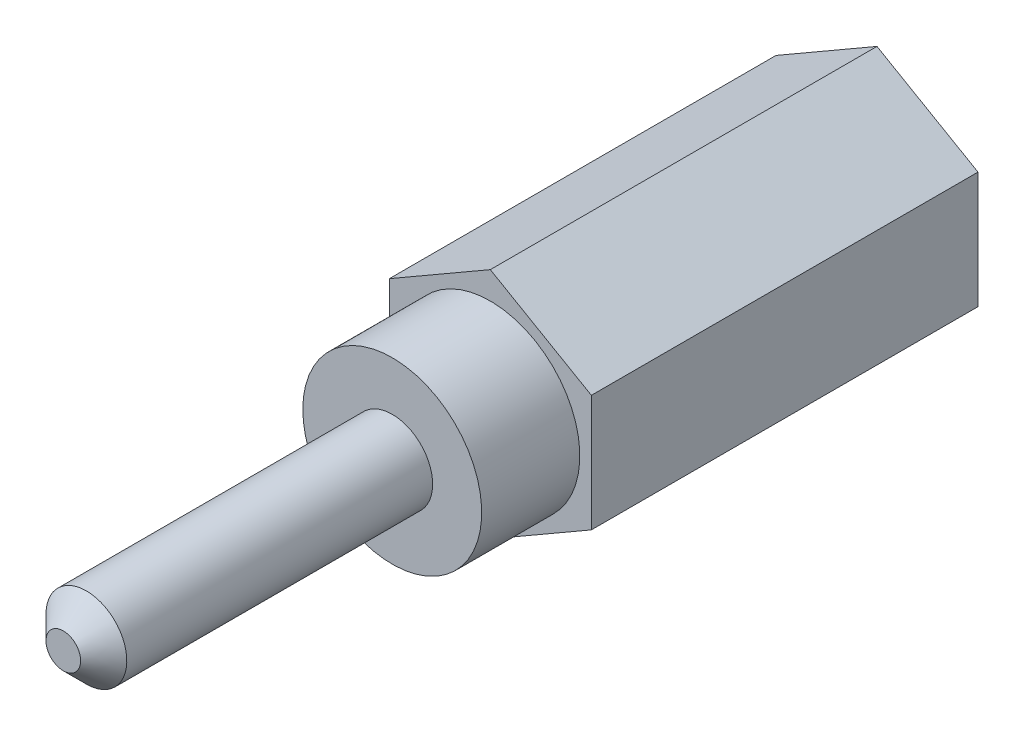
ISO-10303-21;
HEADER;
FILE_DESCRIPTION(('STEP AP214'),'2;1');
FILE_NAME('part.step','',(''),(''),'','','');
FILE_SCHEMA(('AUTOMOTIVE_DESIGN { 1 0 10303 214 1 1 1 1 }'));
ENDSEC;
DATA;
#1=APPLICATION_CONTEXT('core data for automotive mechanical design processes');
#2=APPLICATION_PROTOCOL_DEFINITION('international standard','automotive_design',2000,#1);
#3=PRODUCT_CONTEXT('',#1,'mechanical');
#4=PRODUCT('Part','Part','',(#3));
#5=PRODUCT_RELATED_PRODUCT_CATEGORY('part','',(#4));
#6=PRODUCT_DEFINITION_FORMATION('','',#4);
#7=PRODUCT_DEFINITION_CONTEXT('part definition',#1,'design');
#8=PRODUCT_DEFINITION('design','',#6,#7);
#9=PRODUCT_DEFINITION_SHAPE('','',#8);
#10=(LENGTH_UNIT() NAMED_UNIT(*) SI_UNIT(.MILLI.,.METRE.));
#11=(NAMED_UNIT(*) PLANE_ANGLE_UNIT() SI_UNIT($,.RADIAN.));
#12=(NAMED_UNIT(*) SI_UNIT($,.STERADIAN.) SOLID_ANGLE_UNIT());
#13=UNCERTAINTY_MEASURE_WITH_UNIT(LENGTH_MEASURE(1.E-05),#10,'distance_accuracy_value','');
#14=(GEOMETRIC_REPRESENTATION_CONTEXT(3) GLOBAL_UNCERTAINTY_ASSIGNED_CONTEXT((#13)) GLOBAL_UNIT_ASSIGNED_CONTEXT((#10,
#11,#12)) REPRESENTATION_CONTEXT('',''));
#15=CARTESIAN_POINT('',(0.,0.,0.));
#16=DIRECTION('',(0.,0.,1.));
#17=DIRECTION('',(1.,0.,0.));
#18=AXIS2_PLACEMENT_3D('',#15,#16,#17);
#19=CARTESIAN_POINT('',(-4.375,-5.052722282,-21.));
#20=DIRECTION('',(0.,0.,1.));
#21=DIRECTION('',(1.,0.,0.));
#22=AXIS2_PLACEMENT_3D('',#19,#20,#21);
#23=PLANE('',#22);
#24=DIRECTION('',(0.866025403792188,0.499999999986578,0.));
#25=VECTOR('',#24,1.);
#26=CARTESIAN_POINT('',(-2.1882858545,3.7884074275,-21.));
#27=LINE('',#26,#25);
#28=CARTESIAN_POINT('',(-4.375,2.52590742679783,-21.));
#29=VERTEX_POINT('',#28);
#30=CARTESIAN_POINT('',(-0.00157170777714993,5.05090742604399,-21.));
#31=VERTEX_POINT('',#30);
#32=EDGE_CURVE('E61',#29,#31,#27,.T.);
#33=ORIENTED_EDGE('',*,*,#32,.T.);
#34=DIRECTION('',(0.866025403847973,-0.499999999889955,0.));
#35=VECTOR('',#34,1.);
#36=CARTESIAN_POINT('',(2.186714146,3.7874999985,-21.));
#37=LINE('',#36,#35);
#38=CARTESIAN_POINT('',(4.375,2.52409257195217,-21.));
#39=VERTEX_POINT('',#38);
#40=EDGE_CURVE('E136',#31,#39,#37,.T.);
#41=ORIENTED_EDGE('',*,*,#40,.T.);
#42=DIRECTION('',(0.,-1.,0.));
#43=VECTOR('',#42,1.);
#44=CARTESIAN_POINT('',(4.375,-0.000907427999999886,-21.));
#45=LINE('',#44,#43);
#46=CARTESIAN_POINT('',(4.375,-2.52590742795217,-21.));
#47=VERTEX_POINT('',#46);
#48=EDGE_CURVE('E100',#39,#47,#45,.T.);
#49=ORIENTED_EDGE('',*,*,#48,.T.);
#50=DIRECTION('',(-0.866025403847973,-0.499999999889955,0.));
#51=VECTOR('',#50,1.);
#52=CARTESIAN_POINT('',(2.186714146,-3.7893148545,-21.));
#53=LINE('',#52,#51);
#54=CARTESIAN_POINT('',(-0.00157171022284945,-5.05272228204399,-21.));
#55=VERTEX_POINT('',#54);
#56=EDGE_CURVE('E98',#47,#55,#53,.T.);
#57=ORIENTED_EDGE('',*,*,#56,.T.);
#58=DIRECTION('',(-0.866025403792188,0.499999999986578,0.));
#59=VECTOR('',#58,1.);
#60=CARTESIAN_POINT('',(-2.1882858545,-3.7902222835,-21.));
#61=LINE('',#60,#59);
#62=CARTESIAN_POINT('',(-4.375,-2.52772228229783,-21.));
#63=VERTEX_POINT('',#62);
#64=EDGE_CURVE('E82',#55,#63,#61,.T.);
#65=ORIENTED_EDGE('',*,*,#64,.T.);
#66=DIRECTION('',(0.,1.,0.));
#67=VECTOR('',#66,1.);
#68=CARTESIAN_POINT('',(-4.375,-0.000907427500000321,-21.));
#69=LINE('',#68,#67);
#70=EDGE_CURVE('E73',#63,#29,#69,.T.);
#71=ORIENTED_EDGE('',*,*,#70,.T.);
#72=EDGE_LOOP('',(#33,#41,#49,#57,#65,#71));
#73=FACE_BOUND('',#72,.T.);
#74=ADVANCED_FACE('F14',(#73),#23,.F.);
#75=CARTESIAN_POINT('',(-4.375,2.525907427,-21.));
#76=DIRECTION('',(0.499999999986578,-0.866025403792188,0.));
#77=DIRECTION('',(0.866025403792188,0.499999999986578,0.));
#78=AXIS2_PLACEMENT_3D('',#75,#76,#77);
#79=PLANE('',#78);
#80=DIRECTION('',(0.,0.,1.));
#81=VECTOR('',#80,1.);
#82=CARTESIAN_POINT('',(-4.375,2.525907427,-12.625));
#83=LINE('',#82,#81);
#84=CARTESIAN_POINT('',(-4.375,2.52590742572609,-4.25));
#85=VERTEX_POINT('',#84);
#86=EDGE_CURVE('E76',#29,#85,#83,.T.);
#87=ORIENTED_EDGE('',*,*,#86,.T.);
#88=DIRECTION('',(-0.866025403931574,-0.499999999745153,0.));
#89=VECTOR('',#88,1.);
#90=CARTESIAN_POINT('',(-0.00157170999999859,5.05090742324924,-4.25));
#91=LINE('',#90,#89);
#92=CARTESIAN_POINT('',(-0.00157170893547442,5.05090742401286,-4.25));
#93=VERTEX_POINT('',#92);
#94=EDGE_CURVE('E18',#93,#85,#91,.T.);
#95=ORIENTED_EDGE('',*,*,#94,.F.);
#96=DIRECTION('',(0.,0.,-1.));
#97=VECTOR('',#96,1.);
#98=CARTESIAN_POINT('',(-0.001571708,5.050907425,-12.625));
#99=LINE('',#98,#97);
#100=EDGE_CURVE('E78',#93,#31,#99,.T.);
#101=ORIENTED_EDGE('',*,*,#100,.T.);
#102=ORIENTED_EDGE('',*,*,#32,.F.);
#103=EDGE_LOOP('',(#87,#95,#101,#102));
#104=FACE_BOUND('',#103,.T.);
#105=ADVANCED_FACE('F75',(#104),#79,.F.);
#106=CARTESIAN_POINT('',(-4.375,-2.527722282,-4.25));
#107=DIRECTION('',(1.,0.,0.));
#108=DIRECTION('',(0.,0.,-1.));
#109=AXIS2_PLACEMENT_3D('',#106,#107,#108);
#110=PLANE('',#109);
#111=DIRECTION('',(0.,0.,1.));
#112=VECTOR('',#111,1.);
#113=CARTESIAN_POINT('',(-4.375,-2.527722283,-12.625));
#114=LINE('',#113,#112);
#115=CARTESIAN_POINT('',(-4.375,-2.52772228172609,-4.25));
#116=VERTEX_POINT('',#115);
#117=EDGE_CURVE('E84',#63,#116,#114,.T.);
#118=ORIENTED_EDGE('',*,*,#117,.T.);
#119=DIRECTION('',(0.,-1.,0.));
#120=VECTOR('',#119,1.);
#121=CARTESIAN_POINT('',(-4.375,-0.000907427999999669,-4.25));
#122=LINE('',#121,#120);
#123=EDGE_CURVE('E88',#85,#116,#122,.T.);
#124=ORIENTED_EDGE('',*,*,#123,.F.);
#125=ORIENTED_EDGE('',*,*,#86,.F.);
#126=ORIENTED_EDGE('',*,*,#70,.F.);
#127=EDGE_LOOP('',(#118,#124,#125,#126));
#128=FACE_BOUND('',#127,.T.);
#129=ADVANCED_FACE('F86',(#128),#110,.F.);
#130=CARTESIAN_POINT('',(-0.001571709,-5.052722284,-21.));
#131=DIRECTION('',(0.499999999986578,0.866025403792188,0.));
#132=DIRECTION('',(-0.866025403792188,0.499999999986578,0.));
#133=AXIS2_PLACEMENT_3D('',#130,#131,#132);
#134=PLANE('',#133);
#135=DIRECTION('',(0.,0.,1.));
#136=VECTOR('',#135,1.);
#137=CARTESIAN_POINT('',(-0.001571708,-5.052722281,-12.625));
#138=LINE('',#137,#136);
#139=CARTESIAN_POINT('',(-0.00157170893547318,-5.05272228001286,-4.25));
#140=VERTEX_POINT('',#139);
#141=EDGE_CURVE('E96',#55,#140,#138,.T.);
#142=ORIENTED_EDGE('',*,*,#141,.T.);
#143=DIRECTION('',(0.866025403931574,-0.499999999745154,0.));
#144=VECTOR('',#143,1.);
#145=CARTESIAN_POINT('',(-4.375,-2.52772228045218,-4.25));
#146=LINE('',#145,#144);
#147=EDGE_CURVE('E94',#116,#140,#146,.T.);
#148=ORIENTED_EDGE('',*,*,#147,.F.);
#149=ORIENTED_EDGE('',*,*,#117,.F.);
#150=ORIENTED_EDGE('',*,*,#64,.F.);
#151=EDGE_LOOP('',(#142,#148,#149,#150));
#152=FACE_BOUND('',#151,.T.);
#153=ADVANCED_FACE('F124',(#152),#134,.F.);
#154=CARTESIAN_POINT('',(4.375,-2.525907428,-21.));
#155=DIRECTION('',(-0.499999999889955,0.866025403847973,0.));
#156=DIRECTION('',(-0.866025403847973,-0.499999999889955,0.));
#157=AXIS2_PLACEMENT_3D('',#154,#155,#156);
#158=PLANE('',#157);
#159=DIRECTION('',(0.,0.,1.));
#160=VECTOR('',#159,1.);
#161=CARTESIAN_POINT('',(4.375,-2.525907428,-12.625));
#162=LINE('',#161,#160);
#163=CARTESIAN_POINT('',(4.375,-2.52590742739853,-4.25));
#164=VERTEX_POINT('',#163);
#165=EDGE_CURVE('E99',#47,#164,#162,.T.);
#166=ORIENTED_EDGE('',*,*,#165,.T.);
#167=DIRECTION('',(0.866025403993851,0.499999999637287,0.));
#168=VECTOR('',#167,1.);
#169=CARTESIAN_POINT('',(-0.00157170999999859,-5.05272227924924,-4.25));
#170=LINE('',#169,#168);
#171=EDGE_CURVE('E115',#140,#164,#170,.T.);
#172=ORIENTED_EDGE('',*,*,#171,.F.);
#173=ORIENTED_EDGE('',*,*,#141,.F.);
#174=ORIENTED_EDGE('',*,*,#56,.F.);
#175=EDGE_LOOP('',(#166,#172,#173,#174));
#176=FACE_BOUND('',#175,.T.);
#177=ADVANCED_FACE('F127',(#176),#158,.F.);
#178=CARTESIAN_POINT('',(4.375,2.524092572,-21.));
#179=DIRECTION('',(-1.,0.,0.));
#180=DIRECTION('',(0.,-1.,0.));
#181=AXIS2_PLACEMENT_3D('',#178,#179,#180);
#182=PLANE('',#181);
#183=DIRECTION('',(0.,0.,1.));
#184=VECTOR('',#183,1.);
#185=CARTESIAN_POINT('',(4.375,2.524092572,-12.625));
#186=LINE('',#185,#184);
#187=CARTESIAN_POINT('',(4.375,2.52409257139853,-4.25));
#188=VERTEX_POINT('',#187);
#189=EDGE_CURVE('E33',#39,#188,#186,.T.);
#190=ORIENTED_EDGE('',*,*,#189,.T.);
#191=DIRECTION('',(0.,1.,0.));
#192=VECTOR('',#191,1.);
#193=CARTESIAN_POINT('',(4.375,-0.000907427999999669,-4.25));
#194=LINE('',#193,#192);
#195=EDGE_CURVE('E114',#164,#188,#194,.T.);
#196=ORIENTED_EDGE('',*,*,#195,.F.);
#197=ORIENTED_EDGE('',*,*,#165,.F.);
#198=ORIENTED_EDGE('',*,*,#48,.F.);
#199=EDGE_LOOP('',(#190,#196,#197,#198));
#200=FACE_BOUND('',#199,.T.);
#201=ADVANCED_FACE('F130',(#200),#182,.F.);
#202=CARTESIAN_POINT('',(-0.001571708,5.050907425,-21.));
#203=DIRECTION('',(-0.499999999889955,-0.866025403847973,0.));
#204=DIRECTION('',(0.866025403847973,-0.499999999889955,0.));
#205=AXIS2_PLACEMENT_3D('',#202,#203,#204);
#206=PLANE('',#205);
#207=ORIENTED_EDGE('',*,*,#100,.F.);
#208=DIRECTION('',(-0.866025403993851,0.499999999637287,0.));
#209=VECTOR('',#208,1.);
#210=CARTESIAN_POINT('',(4.375,2.52409257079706,-4.25));
#211=LINE('',#210,#209);
#212=EDGE_CURVE('E111',#188,#93,#211,.T.);
#213=ORIENTED_EDGE('',*,*,#212,.F.);
#214=ORIENTED_EDGE('',*,*,#189,.F.);
#215=ORIENTED_EDGE('',*,*,#40,.F.);
#216=EDGE_LOOP('',(#207,#213,#214,#215));
#217=FACE_BOUND('',#216,.T.);
#218=ADVANCED_FACE('F174',(#217),#206,.F.);
#219=CARTESIAN_POINT('',(-4.375,-5.11334406,-4.25));
#220=DIRECTION('',(0.,0.,1.));
#221=DIRECTION('',(1.,0.,0.));
#222=AXIS2_PLACEMENT_3D('',#219,#220,#221);
#223=PLANE('',#222);
#224=CARTESIAN_POINT('',(0.,0.,-4.25));
#225=DIRECTION('',(0.,0.,-1.));
#226=DIRECTION('',(-1.,0.,0.));
#227=AXIS2_PLACEMENT_3D('',#224,#225,#226);
#228=CIRCLE('',#227,3.875);
#229=CARTESIAN_POINT('',(-3.875,0.,-4.25));
#230=VERTEX_POINT('',#229);
#231=EDGE_CURVE('E108',#230,#230,#228,.T.);
#232=ORIENTED_EDGE('',*,*,#231,.T.);
#233=EDGE_LOOP('',(#232));
#234=FACE_BOUND('',#233,.T.);
#235=ORIENTED_EDGE('',*,*,#195,.T.);
#236=ORIENTED_EDGE('',*,*,#212,.T.);
#237=ORIENTED_EDGE('',*,*,#94,.T.);
#238=ORIENTED_EDGE('',*,*,#123,.T.);
#239=ORIENTED_EDGE('',*,*,#147,.T.);
#240=ORIENTED_EDGE('',*,*,#171,.T.);
#241=EDGE_LOOP('',(#235,#236,#237,#238,#239,#240));
#242=FACE_BOUND('',#241,.T.);
#243=ADVANCED_FACE('F121',(#234,#242),#223,.T.);
#244=CARTESIAN_POINT('',(0.,0.,0.));
#245=DIRECTION('',(0.,0.,-1.));
#246=DIRECTION('',(-1.,0.,0.));
#247=AXIS2_PLACEMENT_3D('',#244,#245,#246);
#248=CYLINDRICAL_SURFACE('',#247,3.875);
#249=ORIENTED_EDGE('',*,*,#231,.F.);
#250=EDGE_LOOP('',(#249));
#251=FACE_BOUND('',#250,.T.);
#252=CARTESIAN_POINT('',(0.,0.,0.));
#253=DIRECTION('',(0.,0.,-1.));
#254=DIRECTION('',(-1.,0.,0.));
#255=AXIS2_PLACEMENT_3D('',#252,#253,#254);
#256=CIRCLE('',#255,3.875);
#257=CARTESIAN_POINT('',(-3.875,0.,0.));
#258=VERTEX_POINT('',#257);
#259=EDGE_CURVE('E105',#258,#258,#256,.F.);
#260=ORIENTED_EDGE('',*,*,#259,.F.);
#261=EDGE_LOOP('',(#260));
#262=FACE_BOUND('',#261,.T.);
#263=ADVANCED_FACE('F158',(#251,#262),#248,.T.);
#264=CARTESIAN_POINT('',(-3.9215,-3.9215,0.));
#265=DIRECTION('',(0.,0.,1.));
#266=DIRECTION('',(1.,0.,0.));
#267=AXIS2_PLACEMENT_3D('',#264,#265,#266);
#268=PLANE('',#267);
#269=CARTESIAN_POINT('',(0.,0.,0.));
#270=DIRECTION('',(0.,0.,-1.));
#271=DIRECTION('',(0.,1.,0.));
#272=AXIS2_PLACEMENT_3D('',#269,#270,#271);
#273=CIRCLE('',#272,1.75);
#274=CARTESIAN_POINT('',(0.,1.74999999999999,0.));
#275=VERTEX_POINT('',#274);
#276=EDGE_CURVE('E102',#275,#275,#273,.T.);
#277=ORIENTED_EDGE('',*,*,#276,.T.);
#278=EDGE_LOOP('',(#277));
#279=FACE_BOUND('',#278,.T.);
#280=ORIENTED_EDGE('',*,*,#259,.T.);
#281=EDGE_LOOP('',(#280));
#282=FACE_BOUND('',#281,.T.);
#283=ADVANCED_FACE('F156',(#279,#282),#268,.T.);
#284=CARTESIAN_POINT('',(0.,0.,13.25));
#285=DIRECTION('',(0.,0.,-1.));
#286=DIRECTION('',(0.,1.,0.));
#287=AXIS2_PLACEMENT_3D('',#284,#285,#286);
#288=CYLINDRICAL_SURFACE('',#287,1.75);
#289=ORIENTED_EDGE('',*,*,#276,.F.);
#290=EDGE_LOOP('',(#289));
#291=FACE_BOUND('',#290,.T.);
#292=CARTESIAN_POINT('',(0.,0.,13.25));
#293=DIRECTION('',(0.,0.,-1.));
#294=DIRECTION('',(-1.,0.,0.));
#295=AXIS2_PLACEMENT_3D('',#292,#293,#294);
#296=CIRCLE('',#295,1.75);
#297=CARTESIAN_POINT('',(-1.75,0.,13.25));
#298=VERTEX_POINT('',#297);
#299=EDGE_CURVE('E24',#298,#298,#296,.T.);
#300=ORIENTED_EDGE('',*,*,#299,.T.);
#301=EDGE_LOOP('',(#300));
#302=FACE_BOUND('',#301,.T.);
#303=ADVANCED_FACE('F141',(#291,#302),#288,.T.);
#304=CARTESIAN_POINT('',(-0.759,-0.759,14.25));
#305=DIRECTION('',(0.,0.,1.));
#306=DIRECTION('',(1.,0.,0.));
#307=AXIS2_PLACEMENT_3D('',#304,#305,#306);
#308=PLANE('',#307);
#309=CARTESIAN_POINT('',(0.,0.,14.2500000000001));
#310=DIRECTION('',(0.,0.,-1.));
#311=DIRECTION('',(0.,1.,0.));
#312=AXIS2_PLACEMENT_3D('',#309,#310,#311);
#313=CIRCLE('',#312,0.749999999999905);
#314=CARTESIAN_POINT('',(0.,0.749999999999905,14.2500000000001));
#315=VERTEX_POINT('',#314);
#316=EDGE_CURVE('E9',#315,#315,#313,.F.);
#317=ORIENTED_EDGE('',*,*,#316,.T.);
#318=EDGE_LOOP('',(#317));
#319=FACE_BOUND('',#318,.T.);
#320=ADVANCED_FACE('F16',(#319),#308,.T.);
#321=CARTESIAN_POINT('',(0.,0.,14.25));
#322=DIRECTION('',(0.,0.,-1.));
#323=DIRECTION('',(0.,1.,0.));
#324=AXIS2_PLACEMENT_3D('',#321,#322,#323);
#325=CONICAL_SURFACE('',#324,0.75,0.785398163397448);
#326=ORIENTED_EDGE('',*,*,#316,.F.);
#327=EDGE_LOOP('',(#326));
#328=FACE_BOUND('',#327,.T.);
#329=ORIENTED_EDGE('',*,*,#299,.F.);
#330=EDGE_LOOP('',(#329));
#331=FACE_BOUND('',#330,.T.);
#332=ADVANCED_FACE('F143',(#328,#331),#325,.T.);
#333=CLOSED_SHELL('',(#74,#105,#129,#153,#177,#201,#218,#243,#263,#283,#303,#320,#332));
#334=MANIFOLD_SOLID_BREP('B1',#333);
#335=ADVANCED_BREP_SHAPE_REPRESENTATION('',(#18,#334),#14);
#336=SHAPE_DEFINITION_REPRESENTATION(#9,#335);
ENDSEC;
END-ISO-10303-21;
